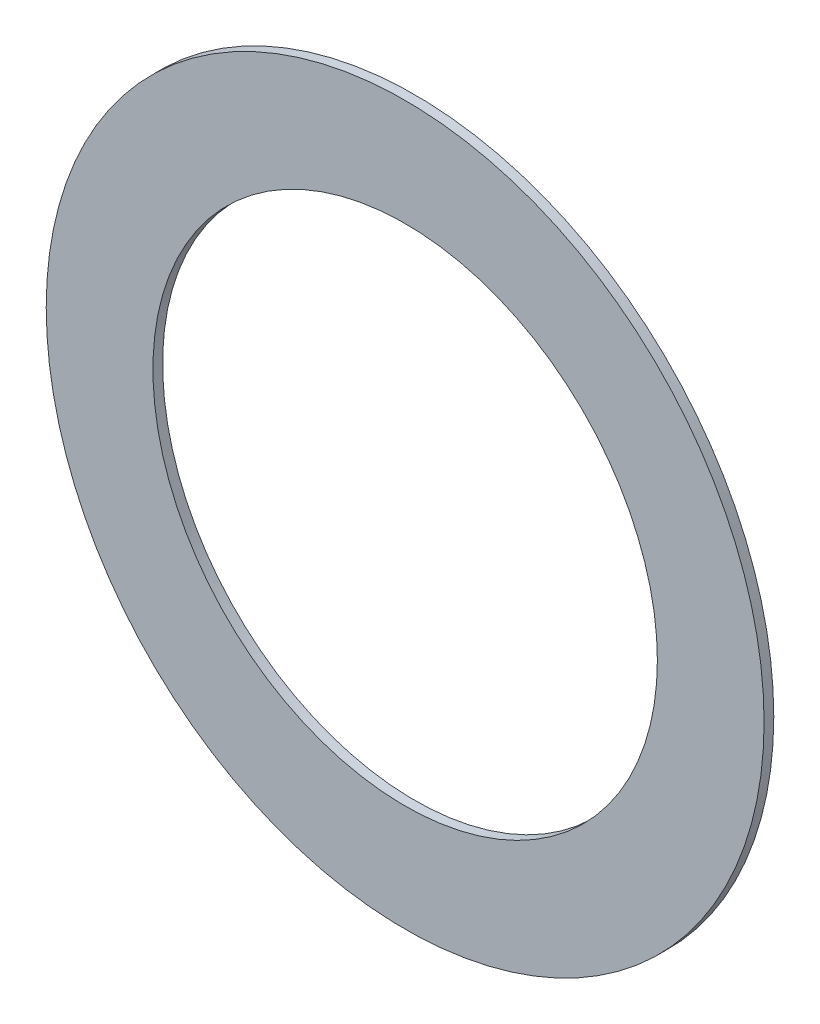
from build123d import *

# Parameters (mm, degrees)
ESQUISSE1_W = 0.25
ESQUISSE1_H = 2.75


with BuildPart() as part:
    # Esquisse1 → Base-R_volution (revolve)
    with BuildSketch(Plane(origin=(0, 0, 0), x_dir=(0, 0, -1), z_dir=(1, 0, 0)), mode=Mode.PRIVATE) as base_r_volution_sk:
        with Locations((0, 7.875)):
            Rectangle(ESQUISSE1_W, ESQUISSE1_H)
    revolve(base_r_volution_sk.sketch.rotate(Axis((0, 0, 0), (0, 0, -1)), 90), axis=Axis((0, 0, 0), (0, 0, -1)))


solid = part.part
